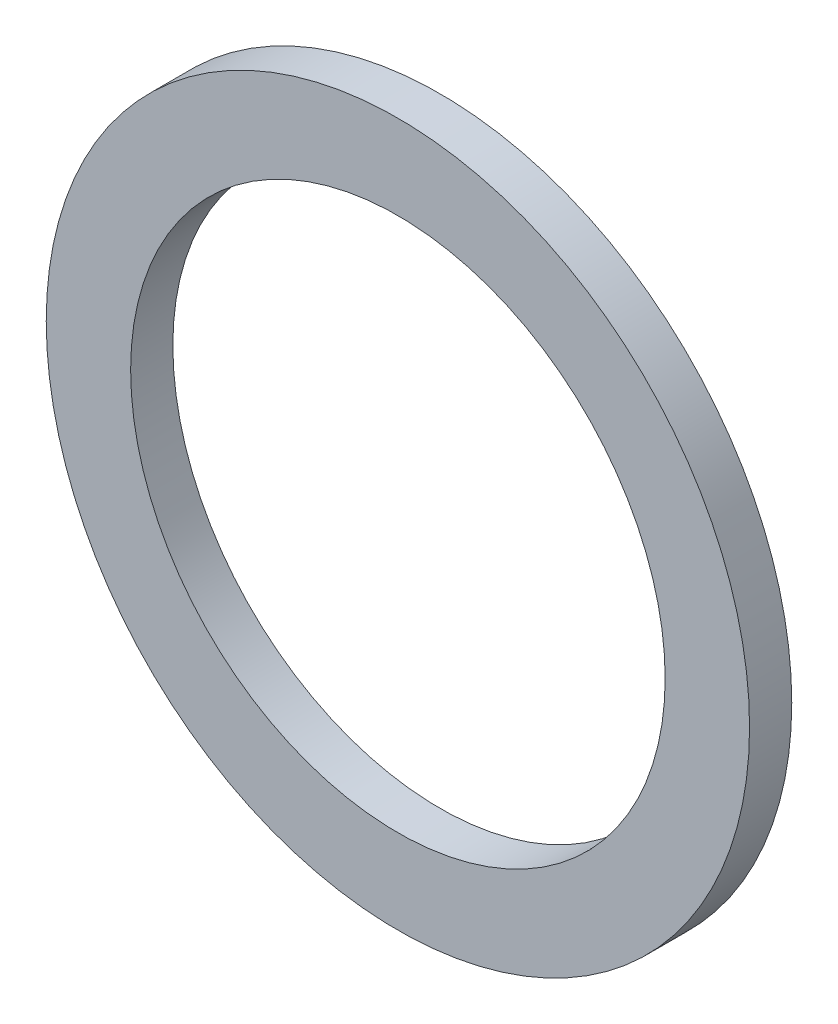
from build123d import *

# Parameters (mm, degrees)
SKETCH1_R          = 12.7
SKETCH1_R_2        = 9.652
BASE_EXTRUDE_DEPTH = 1.524


with BuildPart() as part:
    # Sketch1 → Base-Extrude (new body)
    with BuildSketch(Plane.XY):
        Circle(SKETCH1_R)
        Circle(SKETCH1_R_2, mode=Mode.SUBTRACT)
    extrude(amount=-BASE_EXTRUDE_DEPTH)


solid = part.part
